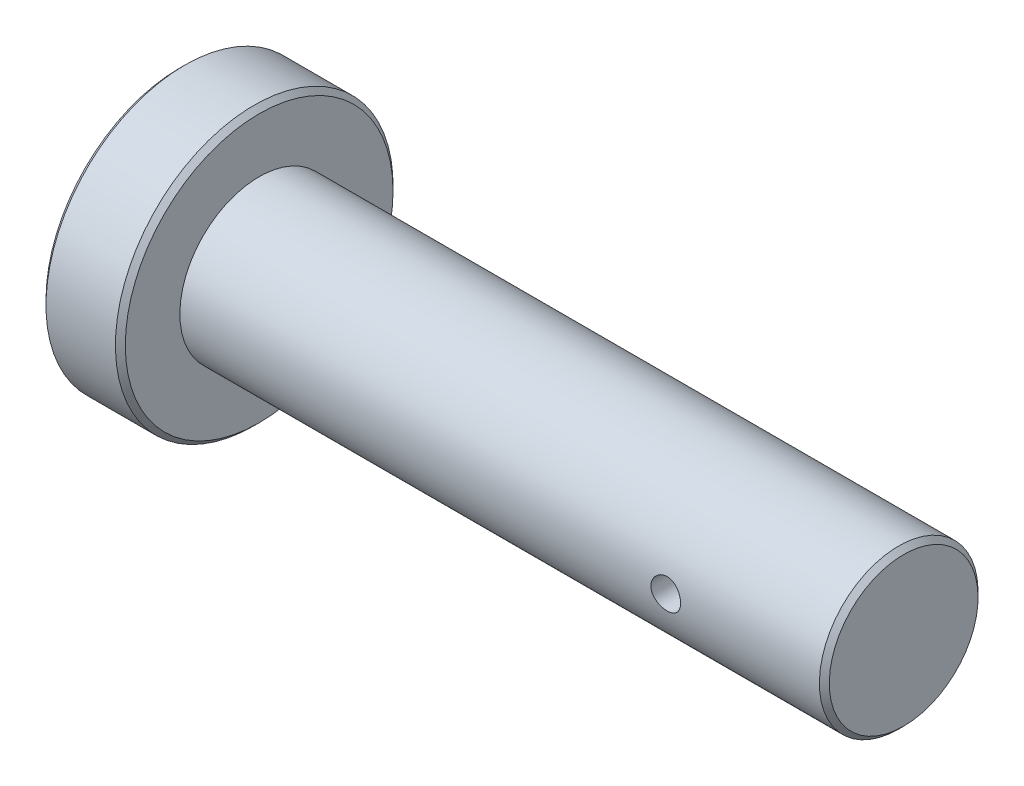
from build123d import *

# Parameters (mm, degrees)
SKETCH3_R          = 1.5
CUT_EXTRUDE1_DEPTH = 20
CHAMFER1_SIZE      = 0.5
SCALE1_SCALE       = 0.7
SCALE2_SCALE       = 0.5
SCALE3_SCALE       = 1.25


with BuildPart() as part:
    # Sketch2 → Revolve1 (revolve)
    with BuildSketch(Plane.XY, mode=Mode.PRIVATE) as revolve1_sk:
        Polygon((0, 0), (0, 14), (8, 14), (8, 8), (73, 8), (73, 0), align=None)
    revolve(revolve1_sk.sketch.rotate(Axis((0, 0, 0), (1, 0, 0)), 180), axis=Axis((0, 0, 0), (1, 0, 0)))

    # Sketch3 → Cut-Extrude1 (cut, symmetric)
    with BuildSketch(Plane.XY):
        with Locations((57, 0)):
            Circle(SKETCH3_R)
    extrude(amount=CUT_EXTRUDE1_DEPTH, both=True, mode=Mode.SUBTRACT)

    # Chamfer1
    chamfer1_edges = [part.edges().sort_by_distance(p)[0] for p in [
        (73, 8, 0),
        (8, 14, 0),
        (0, 14, 0),
    ]]
    chamfer(chamfer1_edges, length=CHAMFER1_SIZE)


with BuildPart() as part_1:
    # Scale1: scaled about (30.358995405, 5.35e-07, 0)
    add(part.part.scale(SCALE1_SCALE).moved(Location((9.107698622, 1.61e-07, 0))))


with BuildPart() as part_2:
    # Scale2: scaled about (30.358995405, 5.35e-07, 0)
    add(part_1.part.scale(SCALE2_SCALE).moved(Location((15.179497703, 2.67e-07, 0))))


with BuildPart() as part_3:
    # Scale3: scaled about (30.358995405, 5.35e-07, 0)
    add(part_2.part.scale(SCALE3_SCALE).moved(Location((-7.589748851, -1.34e-07, 0))))


solid = part_3.part
